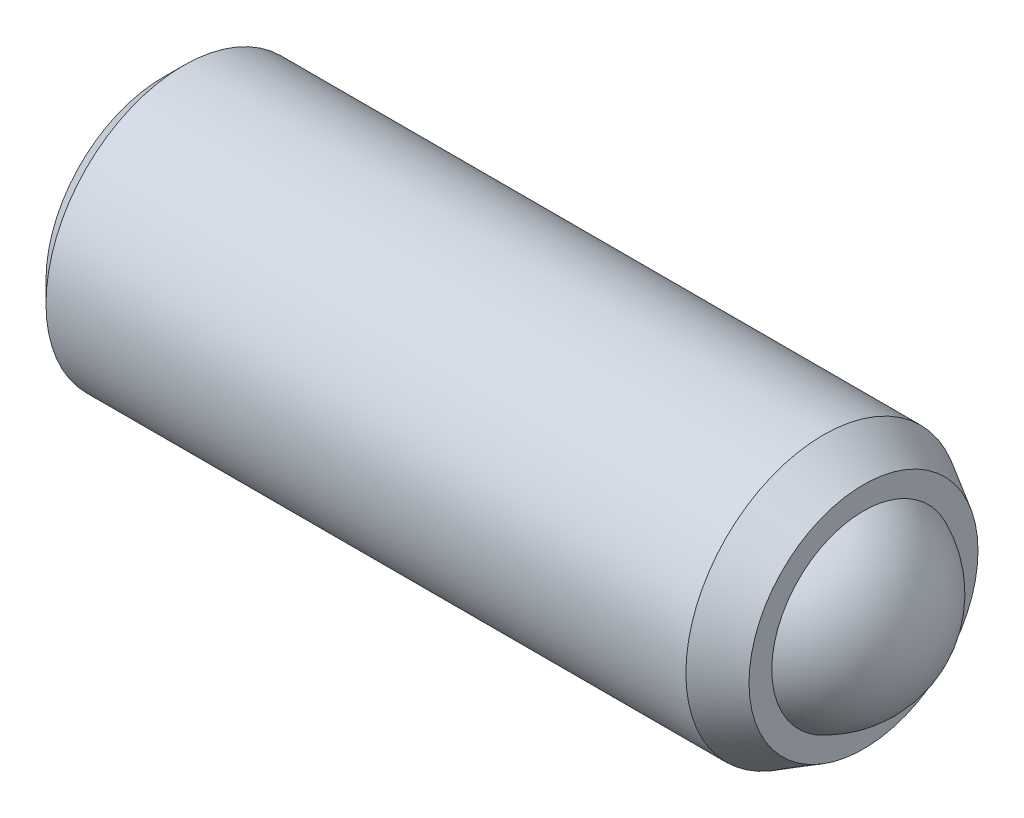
ISO-10303-21;
HEADER;
FILE_DESCRIPTION(('STEP AP214'),'2;1');
FILE_NAME('part.step','',(''),(''),'','','');
FILE_SCHEMA(('AUTOMOTIVE_DESIGN { 1 0 10303 214 1 1 1 1 }'));
ENDSEC;
DATA;
#1=APPLICATION_CONTEXT('core data for automotive mechanical design processes');
#2=APPLICATION_PROTOCOL_DEFINITION('international standard','automotive_design',2000,#1);
#3=PRODUCT_CONTEXT('',#1,'mechanical');
#4=PRODUCT('Part','Part','',(#3));
#5=PRODUCT_RELATED_PRODUCT_CATEGORY('part','',(#4));
#6=PRODUCT_DEFINITION_FORMATION('','',#4);
#7=PRODUCT_DEFINITION_CONTEXT('part definition',#1,'design');
#8=PRODUCT_DEFINITION('design','',#6,#7);
#9=PRODUCT_DEFINITION_SHAPE('','',#8);
#10=(LENGTH_UNIT() NAMED_UNIT(*) SI_UNIT(.MILLI.,.METRE.));
#11=(NAMED_UNIT(*) PLANE_ANGLE_UNIT() SI_UNIT($,.RADIAN.));
#12=(NAMED_UNIT(*) SI_UNIT($,.STERADIAN.) SOLID_ANGLE_UNIT());
#13=UNCERTAINTY_MEASURE_WITH_UNIT(LENGTH_MEASURE(1.E-05),#10,'distance_accuracy_value','');
#14=(GEOMETRIC_REPRESENTATION_CONTEXT(3) GLOBAL_UNCERTAINTY_ASSIGNED_CONTEXT((#13)) GLOBAL_UNIT_ASSIGNED_CONTEXT((#10,
#11,#12)) REPRESENTATION_CONTEXT('',''));
#15=CARTESIAN_POINT('',(0.,0.,0.));
#16=DIRECTION('',(0.,0.,1.));
#17=DIRECTION('',(1.,0.,0.));
#18=AXIS2_PLACEMENT_3D('',#15,#16,#17);
#19=CARTESIAN_POINT('',(13.2,0.,0.));
#20=DIRECTION('',(0.,-1.,0.));
#21=DIRECTION('',(-1.,0.,0.));
#22=AXIS2_PLACEMENT_3D('',#19,#20,#21);
#23=SPHERICAL_SURFACE('',#22,2.);
#24=CARTESIAN_POINT('',(13.2,-2.,0.));
#25=VERTEX_POINT('',#24);
#26=VERTEX_LOOP('',#25);
#27=FACE_BOUND('',#26,.T.);
#28=ADVANCED_FACE('P0_F11',(#27),#23,.T.);
#29=CLOSED_SHELL('',(#28));
#30=MANIFOLD_SOLID_BREP('P0_B1',#29);
#31=CARTESIAN_POINT('',(0.,0.,0.));
#32=DIRECTION('',(1.,0.,0.));
#33=DIRECTION('',(0.,0.,-1.));
#34=AXIS2_PLACEMENT_3D('',#31,#32,#33);
#35=PLANE('',#34);
#36=CARTESIAN_POINT('',(0.,0.,0.));
#37=DIRECTION('',(-1.,0.,0.));
#38=DIRECTION('',(0.,0.,1.));
#39=AXIS2_PLACEMENT_3D('',#36,#37,#38);
#40=CIRCLE('',#39,2.3375);
#41=CARTESIAN_POINT('',(0.,0.,2.3375));
#42=VERTEX_POINT('',#41);
#43=EDGE_CURVE('P1_E10',#42,#42,#40,.T.);
#44=ORIENTED_EDGE('',*,*,#43,.T.);
#45=EDGE_LOOP('',(#44));
#46=FACE_BOUND('',#45,.T.);
#47=ADVANCED_FACE('P1_F15',(#46),#35,.F.);
#48=CARTESIAN_POINT('',(0.4125,0.,0.));
#49=DIRECTION('',(1.,0.,0.));
#50=DIRECTION('',(0.,0.,-1.));
#51=AXIS2_PLACEMENT_3D('',#48,#49,#50);
#52=CONICAL_SURFACE('',#51,2.75,0.78539816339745);
#53=ORIENTED_EDGE('',*,*,#43,.F.);
#54=EDGE_LOOP('',(#53));
#55=FACE_BOUND('',#54,.T.);
#56=CARTESIAN_POINT('',(0.4125,0.,0.));
#57=DIRECTION('',(-1.,0.,0.));
#58=DIRECTION('',(0.,0.,1.));
#59=AXIS2_PLACEMENT_3D('',#56,#57,#58);
#60=CIRCLE('',#59,2.75);
#61=CARTESIAN_POINT('',(0.4125,0.,2.75));
#62=VERTEX_POINT('',#61);
#63=EDGE_CURVE('P1_E21',#62,#62,#60,.T.);
#64=ORIENTED_EDGE('',*,*,#63,.T.);
#65=EDGE_LOOP('',(#64));
#66=FACE_BOUND('',#65,.T.);
#67=ADVANCED_FACE('P1_F39',(#55,#66),#52,.T.);
#68=CARTESIAN_POINT('',(0.,0.,0.));
#69=DIRECTION('',(-1.,0.,0.));
#70=DIRECTION('',(0.,0.,1.));
#71=AXIS2_PLACEMENT_3D('',#68,#69,#70);
#72=CYLINDRICAL_SURFACE('',#71,2.75);
#73=ORIENTED_EDGE('',*,*,#63,.F.);
#74=EDGE_LOOP('',(#73));
#75=FACE_BOUND('',#74,.T.);
#76=CARTESIAN_POINT('',(13.2,0.,0.));
#77=DIRECTION('',(-1.,0.,0.));
#78=DIRECTION('',(0.,0.,1.));
#79=AXIS2_PLACEMENT_3D('',#76,#77,#78);
#80=CIRCLE('',#79,2.75);
#81=CARTESIAN_POINT('',(13.2,0.,2.75));
#82=VERTEX_POINT('',#81);
#83=EDGE_CURVE('P1_E52',#82,#82,#80,.T.);
#84=ORIENTED_EDGE('',*,*,#83,.T.);
#85=EDGE_LOOP('',(#84));
#86=FACE_BOUND('',#85,.T.);
#87=ADVANCED_FACE('P1_F45',(#75,#86),#72,.T.);
#88=CARTESIAN_POINT('',(14.,0.,0.));
#89=DIRECTION('',(-1.,0.,0.));
#90=DIRECTION('',(0.,0.,1.));
#91=AXIS2_PLACEMENT_3D('',#88,#89,#90);
#92=CONICAL_SURFACE('',#91,2.2881197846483,0.523598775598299);
#93=ORIENTED_EDGE('',*,*,#83,.F.);
#94=EDGE_LOOP('',(#93));
#95=FACE_BOUND('',#94,.T.);
#96=CARTESIAN_POINT('',(14.,0.,0.));
#97=DIRECTION('',(-1.,0.,0.));
#98=DIRECTION('',(0.,0.,1.));
#99=AXIS2_PLACEMENT_3D('',#96,#97,#98);
#100=CIRCLE('',#99,2.2881197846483);
#101=CARTESIAN_POINT('',(14.,0.,2.2881197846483));
#102=VERTEX_POINT('',#101);
#103=EDGE_CURVE('P1_E54',#102,#102,#100,.T.);
#104=ORIENTED_EDGE('',*,*,#103,.T.);
#105=EDGE_LOOP('',(#104));
#106=FACE_BOUND('',#105,.T.);
#107=ADVANCED_FACE('P1_F78',(#95,#106),#92,.T.);
#108=CARTESIAN_POINT('',(14.,2.2881197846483,0.));
#109=DIRECTION('',(-1.,0.,0.));
#110=DIRECTION('',(0.,0.,1.));
#111=AXIS2_PLACEMENT_3D('',#108,#109,#110);
#112=PLANE('',#111);
#113=ORIENTED_EDGE('',*,*,#103,.F.);
#114=EDGE_LOOP('',(#113));
#115=FACE_BOUND('',#114,.T.);
#116=CARTESIAN_POINT('',(14.,0.,0.));
#117=DIRECTION('',(-1.,0.,0.));
#118=DIRECTION('',(0.,0.,1.));
#119=AXIS2_PLACEMENT_3D('',#116,#117,#118);
#120=CIRCLE('',#119,1.83303027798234);
#121=CARTESIAN_POINT('',(14.,0.,1.83303027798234));
#122=VERTEX_POINT('',#121);
#123=EDGE_CURVE('P1_E59',#122,#122,#120,.T.);
#124=ORIENTED_EDGE('',*,*,#123,.T.);
#125=EDGE_LOOP('',(#124));
#126=FACE_BOUND('',#125,.T.);
#127=ADVANCED_FACE('P1_F71',(#115,#126),#112,.F.);
#128=CARTESIAN_POINT('',(13.2,0.,0.));
#129=DIRECTION('',(-1.,0.,0.));
#130=DIRECTION('',(0.,1.,0.));
#131=AXIS2_PLACEMENT_3D('',#128,#129,#130);
#132=SPHERICAL_SURFACE('',#131,2.);
#133=ORIENTED_EDGE('',*,*,#123,.F.);
#134=EDGE_LOOP('',(#133));
#135=FACE_BOUND('',#134,.T.);
#136=CARTESIAN_POINT('',(13.2,0.,0.));
#137=DIRECTION('',(-1.,0.,0.));
#138=DIRECTION('',(0.,0.,1.));
#139=AXIS2_PLACEMENT_3D('',#136,#137,#138);
#140=CIRCLE('',#139,2.);
#141=CARTESIAN_POINT('',(13.2,0.,2.));
#142=VERTEX_POINT('',#141);
#143=EDGE_CURVE('P1_E62',#142,#142,#140,.T.);
#144=ORIENTED_EDGE('',*,*,#143,.T.);
#145=EDGE_LOOP('',(#144));
#146=FACE_BOUND('',#145,.T.);
#147=ADVANCED_FACE('P1_F34',(#135,#146),#132,.F.);
#148=CARTESIAN_POINT('',(0.,0.,0.));
#149=DIRECTION('',(-1.,0.,0.));
#150=DIRECTION('',(0.,0.,1.));
#151=AXIS2_PLACEMENT_3D('',#148,#149,#150);
#152=CYLINDRICAL_SURFACE('',#151,2.);
#153=ORIENTED_EDGE('',*,*,#143,.F.);
#154=EDGE_LOOP('',(#153));
#155=FACE_BOUND('',#154,.T.);
#156=CARTESIAN_POINT('',(2.90470053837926,0.,0.));
#157=DIRECTION('',(-1.,0.,0.));
#158=DIRECTION('',(0.,0.,1.));
#159=AXIS2_PLACEMENT_3D('',#156,#157,#158);
#160=CIRCLE('',#159,2.);
#161=CARTESIAN_POINT('',(2.90470053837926,0.,2.));
#162=VERTEX_POINT('',#161);
#163=EDGE_CURVE('P1_E65',#162,#162,#160,.T.);
#164=ORIENTED_EDGE('',*,*,#163,.T.);
#165=EDGE_LOOP('',(#164));
#166=FACE_BOUND('',#165,.T.);
#167=ADVANCED_FACE('P1_F26',(#155,#166),#152,.F.);
#168=CARTESIAN_POINT('',(1.75,0.,0.));
#169=DIRECTION('',(1.,0.,0.));
#170=DIRECTION('',(0.,0.,-1.));
#171=AXIS2_PLACEMENT_3D('',#168,#169,#170);
#172=CONICAL_SURFACE('',#171,0.,1.0471975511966);
#173=ORIENTED_EDGE('',*,*,#163,.F.);
#174=EDGE_LOOP('',(#173));
#175=FACE_BOUND('',#174,.T.);
#176=CARTESIAN_POINT('',(1.75,0.,0.));
#177=VERTEX_POINT('',#176);
#178=VERTEX_LOOP('',#177);
#179=FACE_BOUND('',#178,.T.);
#180=ADVANCED_FACE('P1_F24',(#175,#179),#172,.F.);
#181=CLOSED_SHELL('',(#47,#67,#87,#107,#127,#147,#167,#180));
#182=MANIFOLD_SOLID_BREP('P1_B1',#181);
#183=ADVANCED_BREP_SHAPE_REPRESENTATION('',(#18,#30,#182),#14);
#184=SHAPE_DEFINITION_REPRESENTATION(#9,#183);
ENDSEC;
END-ISO-10303-21;
